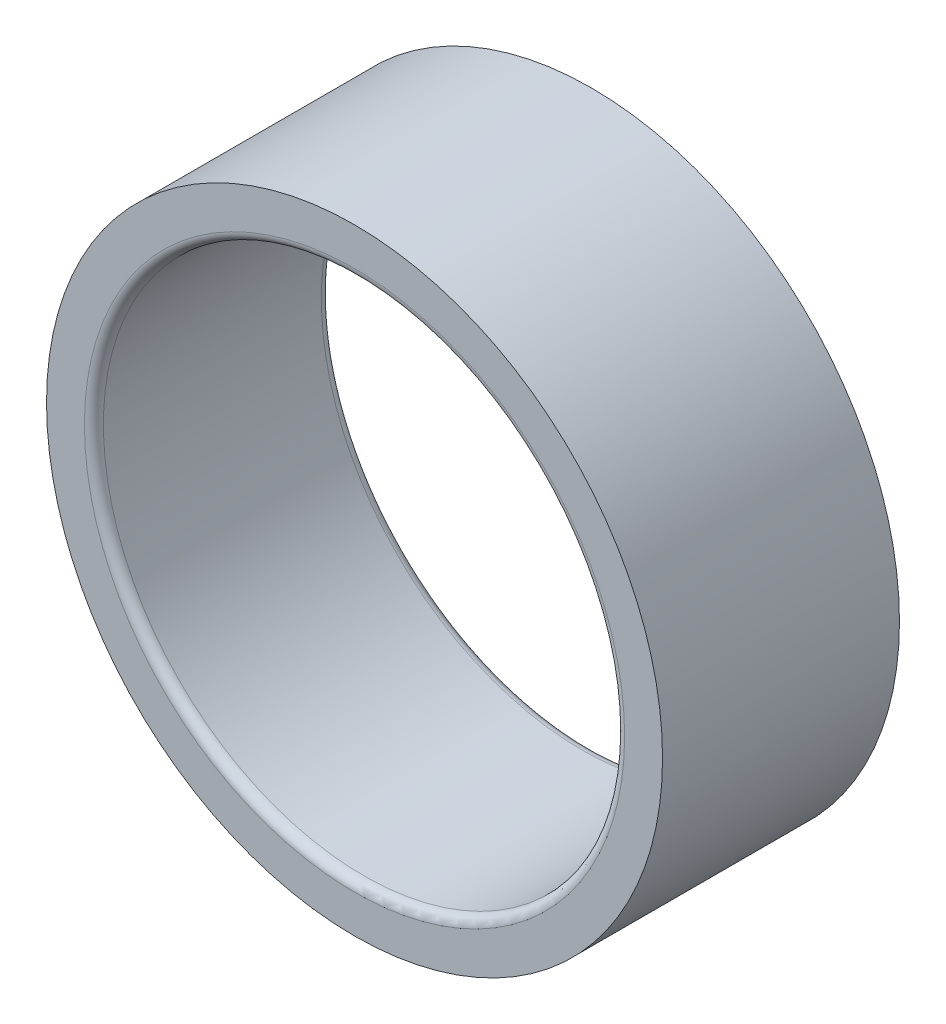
from build123d import *

# Parameters (mm, degrees)
SKETCH1_R      = 65
EXTRUDE1_DEPTH = 50
SKETCH2_R      = 55
EXTRUDE2_DEPTH = 105.642247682
FILLET1_R      = 2


with BuildPart() as part:
    # Sketch1 → Extrude1 (new body)
    with BuildSketch(Plane.XY):
        Circle(SKETCH1_R)
    extrude(amount=EXTRUDE1_DEPTH)

    # Sketch2 → Extrude2 (cut, through all)
    with BuildSketch(Plane.XY.offset(50)):
        Circle(SKETCH2_R)
    extrude(amount=-EXTRUDE2_DEPTH, mode=Mode.SUBTRACT)

    # Fillet1
    fillet1_edges = [part.edges().sort_by_distance(p)[0] for p in [
        (-55, 0, 0),
        (-55, 0, 50),
    ]]
    fillet(fillet1_edges, radius=FILLET1_R)


solid = part.part
